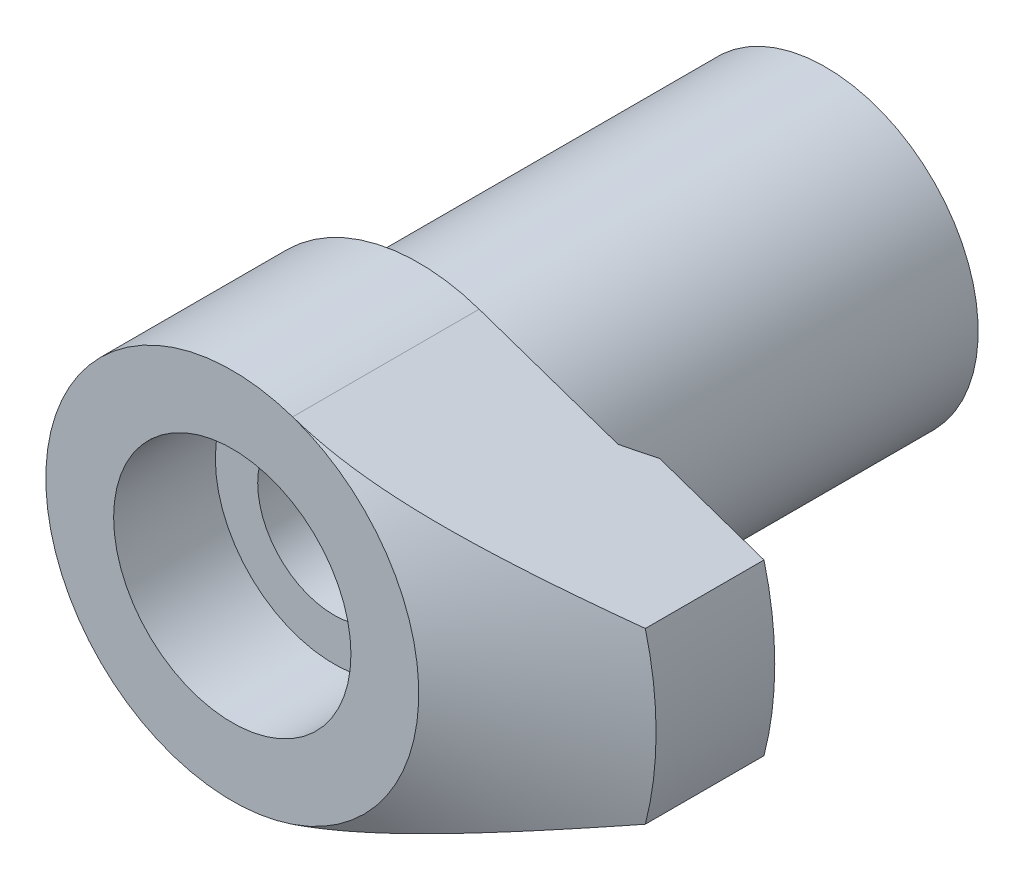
ISO-10303-21;
HEADER;
FILE_DESCRIPTION(('STEP AP214'),'2;1');
FILE_NAME('part.step','',(''),(''),'','','');
FILE_SCHEMA(('AUTOMOTIVE_DESIGN { 1 0 10303 214 1 1 1 1 }'));
ENDSEC;
DATA;
#1=APPLICATION_CONTEXT('core data for automotive mechanical design processes');
#2=APPLICATION_PROTOCOL_DEFINITION('international standard','automotive_design',2000,#1);
#3=PRODUCT_CONTEXT('',#1,'mechanical');
#4=PRODUCT('Part','Part','',(#3));
#5=PRODUCT_RELATED_PRODUCT_CATEGORY('part','',(#4));
#6=PRODUCT_DEFINITION_FORMATION('','',#4);
#7=PRODUCT_DEFINITION_CONTEXT('part definition',#1,'design');
#8=PRODUCT_DEFINITION('design','',#6,#7);
#9=PRODUCT_DEFINITION_SHAPE('','',#8);
#10=(LENGTH_UNIT() NAMED_UNIT(*) SI_UNIT(.MILLI.,.METRE.));
#11=(NAMED_UNIT(*) PLANE_ANGLE_UNIT() SI_UNIT($,.RADIAN.));
#12=(NAMED_UNIT(*) SI_UNIT($,.STERADIAN.) SOLID_ANGLE_UNIT());
#13=UNCERTAINTY_MEASURE_WITH_UNIT(LENGTH_MEASURE(1.E-05),#10,'distance_accuracy_value','');
#14=(GEOMETRIC_REPRESENTATION_CONTEXT(3) GLOBAL_UNCERTAINTY_ASSIGNED_CONTEXT((#13)) GLOBAL_UNIT_ASSIGNED_CONTEXT((#10,
#11,#12)) REPRESENTATION_CONTEXT('',''));
#15=CARTESIAN_POINT('',(0.,0.,0.));
#16=DIRECTION('',(0.,0.,1.));
#17=DIRECTION('',(1.,0.,0.));
#18=AXIS2_PLACEMENT_3D('',#15,#16,#17);
#19=CARTESIAN_POINT('',(3.561184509,-10.407591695,23.));
#20=DIRECTION('',(0.323744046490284,-0.946144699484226,0.));
#21=DIRECTION('',(0.946144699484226,0.323744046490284,0.));
#22=AXIS2_PLACEMENT_3D('',#19,#20,#21);
#23=PLANE('',#22);
#24=DIRECTION('',(0.,0.,1.));
#25=VECTOR('',#24,1.);
#26=CARTESIAN_POINT('',(3.5611845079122,-10.4075916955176,29.));
#27=LINE('',#26,#25);
#28=CARTESIAN_POINT('',(3.56118450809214,-10.4075916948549,34.9999999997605));
#29=VERTEX_POINT('',#28);
#30=CARTESIAN_POINT('',(3.56118450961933,-10.4075916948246,24.));
#31=VERTEX_POINT('',#30);
#32=EDGE_CURVE('E179',#29,#31,#27,.F.);
#33=ORIENTED_EDGE('',*,*,#32,.T.);
#34=DIRECTION('',(-0.946144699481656,-0.323744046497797,0.));
#35=VECTOR('',#34,1.);
#36=CARTESIAN_POINT('',(11.7550379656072,-7.60388600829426,24.));
#37=LINE('',#36,#35);
#38=CARTESIAN_POINT('',(11.7550379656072,-7.60388600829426,24.));
#39=VERTEX_POINT('',#38);
#40=EDGE_CURVE('E183',#39,#31,#37,.T.);
#41=ORIENTED_EDGE('',*,*,#40,.F.);
#42=CARTESIAN_POINT('',(-5.51352459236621,-13.5127013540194,23.405752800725));
#43=CARTESIAN_POINT('',(-5.29385984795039,-13.4375382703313,23.5583055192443));
#44=CARTESIAN_POINT('',(-5.07283624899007,-13.361910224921,23.7087069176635));
#45=CARTESIAN_POINT('',(-4.62770367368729,-13.2095984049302,24.0044490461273));
#46=CARTESIAN_POINT('',(-4.40359392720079,-13.132914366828,24.1497884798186));
#47=CARTESIAN_POINT('',(-3.95088257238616,-12.9780093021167,24.4352956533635));
#48=CARTESIAN_POINT('',(-3.72226389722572,-12.8997824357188,24.5754332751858));
#49=CARTESIAN_POINT('',(-3.26133619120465,-12.742065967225,24.8487307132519));
#50=CARTESIAN_POINT('',(-3.02902740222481,-12.662576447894,24.9818909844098));
#51=CARTESIAN_POINT('',(-2.55370158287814,-12.4999333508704,25.243727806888));
#52=CARTESIAN_POINT('',(-2.31056782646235,-12.416739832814,25.3721695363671));
#53=CARTESIAN_POINT('',(-1.81972825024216,-12.2487883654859,25.618879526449));
#54=CARTESIAN_POINT('',(-1.57202197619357,-12.1640302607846,25.7371467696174));
#55=CARTESIAN_POINT('',(-0.822554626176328,-11.9075836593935,26.0736034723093));
#56=CARTESIAN_POINT('',(-0.313320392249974,-11.733338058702,26.2740849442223));
#57=CARTESIAN_POINT('',(0.513557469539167,-11.4504037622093,26.5422767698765));
#58=CARTESIAN_POINT('',(0.825171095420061,-11.3437783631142,26.6308624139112));
#59=CARTESIAN_POINT('',(1.45420512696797,-11.1285406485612,26.7815153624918));
#60=CARTESIAN_POINT('',(1.77162568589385,-11.0199282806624,26.8435819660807));
#61=CARTESIAN_POINT('',(2.40702756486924,-10.8025116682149,26.9375068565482));
#62=CARTESIAN_POINT('',(2.72496644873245,-10.693721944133,26.9696816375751));
#63=CARTESIAN_POINT('',(3.36230317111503,-10.4756432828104,27.0031334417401));
#64=CARTESIAN_POINT('',(3.68170091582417,-10.3663543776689,27.0044124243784));
#65=CARTESIAN_POINT('',(4.32018584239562,-10.1478828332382,26.9759572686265));
#66=CARTESIAN_POINT('',(4.63926929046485,-10.0387014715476,26.9461310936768));
#67=CARTESIAN_POINT('',(5.2737080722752,-9.82161440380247,26.8570387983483));
#68=CARTESIAN_POINT('',(5.58906301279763,-9.71370883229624,26.7977696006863));
#69=CARTESIAN_POINT('',(6.21598251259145,-9.49919465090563,26.6524021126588));
#70=CARTESIAN_POINT('',(6.52751551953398,-9.39259683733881,26.5661538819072));
#71=CARTESIAN_POINT('',(7.14395167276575,-9.18166976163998,26.3706200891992));
#72=CARTESIAN_POINT('',(7.44885485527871,-9.07734048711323,26.2613346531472));
#73=CARTESIAN_POINT('',(8.11914838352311,-8.84798493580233,25.9968116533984));
#74=CARTESIAN_POINT('',(8.482828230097,-8.72354394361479,25.8367627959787));
#75=CARTESIAN_POINT('',(9.20040315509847,-8.47801003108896,25.4936176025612));
#76=CARTESIAN_POINT('',(9.55429325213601,-8.35691881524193,25.310509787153));
#77=CARTESIAN_POINT('',(10.2537453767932,-8.11758601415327,24.9258005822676));
#78=CARTESIAN_POINT('',(10.5992902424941,-7.9993503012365,24.7241646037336));
#79=CARTESIAN_POINT('',(11.2824049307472,-7.76560771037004,24.3065475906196));
#80=CARTESIAN_POINT('',(11.61997600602,-7.65010040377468,24.090568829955));
#81=CARTESIAN_POINT('',(12.2912184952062,-7.42042014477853,23.6452169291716));
#82=CARTESIAN_POINT('',(12.6248296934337,-7.30626779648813,23.4157428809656));
#83=CARTESIAN_POINT('',(13.2861084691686,-7.07999683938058,22.9474332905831));
#84=CARTESIAN_POINT('',(13.6137758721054,-6.96787829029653,22.7085974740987));
#85=CARTESIAN_POINT('',(14.2636754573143,-6.74550097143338,22.2235885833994));
#86=CARTESIAN_POINT('',(14.5859130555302,-6.63524034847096,21.9774235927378));
#87=CARTESIAN_POINT('',(15.2260352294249,-6.41620858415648,21.4788737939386));
#88=CARTESIAN_POINT('',(15.5439198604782,-6.30743742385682,21.2264890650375));
#89=CARTESIAN_POINT('',(16.2083716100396,-6.08008076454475,20.690404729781));
#90=CARTESIAN_POINT('',(16.5545361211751,-5.96163302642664,20.4061485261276));
#91=CARTESIAN_POINT('',(17.2430098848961,-5.72605671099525,19.8324727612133));
#92=CARTESIAN_POINT('',(17.585319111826,-5.6089281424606,19.5430531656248));
#93=CARTESIAN_POINT('',(18.2667554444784,-5.37575983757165,18.9598186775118));
#94=CARTESIAN_POINT('',(18.6058814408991,-5.25972048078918,18.6660023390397));
#95=CARTESIAN_POINT('',(19.2813000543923,-5.02861126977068,18.0747529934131));
#96=CARTESIAN_POINT('',(19.6175926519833,-4.91354142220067,17.7773199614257));
#97=CARTESIAN_POINT('',(20.2791843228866,-4.68716340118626,17.1870087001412));
#98=CARTESIAN_POINT('',(20.6045451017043,-4.57583411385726,16.8942076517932));
#99=CARTESIAN_POINT('',(21.2532359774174,-4.35387038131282,16.3061024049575));
#100=CARTESIAN_POINT('',(21.5765660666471,-4.24323593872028,16.0107981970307));
#101=CARTESIAN_POINT('',(22.2212557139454,-4.02264131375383,15.4182031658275));
#102=CARTESIAN_POINT('',(22.542616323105,-3.91268077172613,15.120913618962));
#103=CARTESIAN_POINT('',(23.1837590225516,-3.6932998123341,14.5244496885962));
#104=CARTESIAN_POINT('',(23.5035411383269,-3.58387938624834,14.2252753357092));
#105=CARTESIAN_POINT('',(23.8226389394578,-3.47469311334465,13.9252908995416));
#106=B_SPLINE_CURVE_WITH_KNOTS('',3,(#42,#43,#44,#45,#46,#47,#48,#49,#50,#51,#52,#53,#54,#55,
#56,#57,#58,#59,#60,#61,#62,#63,#64,#65,#66,#67,#68,#69,#70,#71,#72,#73,#74,#75,#76,#77,#78,#79,
#80,#81,#82,#83,#84,#85,#86,#87,#88,#89,#90,#91,#92,#93,#94,#95,#96,#97,#98,#99,#100,#101,#102,
#103,#104,#105),.UNSPECIFIED.,.F.,.F.,(4,2,2,2,2,2,2,2,2,2,2,2,2,2,2,2,2,2,2,2,2,2,2,2,2,2,2,2,
2,2,2,4),(0.,0.83342434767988,1.66706058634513,2.50494362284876,3.3427719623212,
4.20440036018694,5.06611481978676,6.78550910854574,7.80779402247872,8.8301059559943,
9.84146601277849,10.8527619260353,11.867058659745,12.88146142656,13.9016051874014,
14.9217433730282,16.1698660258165,17.4186125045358,18.6697394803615,19.9206685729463,
21.1825749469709,22.4445183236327,23.7051179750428,24.9657015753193,26.3555912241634,
27.745490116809,29.1358566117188,30.5262326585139,31.8811642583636,33.2361009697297,
34.5902373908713,35.9443518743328),.UNSPECIFIED.);
#107=CARTESIAN_POINT('',(13.2100050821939,-7.10603727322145,23.));
#108=VERTEX_POINT('',#107);
#109=EDGE_CURVE('E128',#39,#108,#106,.T.);
#110=ORIENTED_EDGE('',*,*,#109,.T.);
#111=DIRECTION('',(0.946144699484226,0.323744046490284,0.));
#112=VECTOR('',#111,1.);
#113=CARTESIAN_POINT('',(3.561184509,-10.407591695,23.));
#114=LINE('',#113,#112);
#115=CARTESIAN_POINT('',(19.3649167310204,-4.99999999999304,23.));
#116=VERTEX_POINT('',#115);
#117=EDGE_CURVE('E62',#108,#116,#114,.T.);
#118=ORIENTED_EDGE('',*,*,#117,.T.);
#119=DIRECTION('',(0.,0.,1.));
#120=VECTOR('',#119,1.);
#121=CARTESIAN_POINT('',(19.364916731,-5.,29.036));
#122=LINE('',#121,#120);
#123=CARTESIAN_POINT('',(19.3649167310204,-4.99999999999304,30.00000000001));
#124=VERTEX_POINT('',#123);
#125=EDGE_CURVE('E80',#116,#124,#122,.T.);
#126=ORIENTED_EDGE('',*,*,#125,.T.);
#127=CARTESIAN_POINT('',(19.3649167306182,-5.00000000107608,30.0000000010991));
#128=CARTESIAN_POINT('',(19.1187005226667,-5.0842482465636,30.1207388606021));
#129=CARTESIAN_POINT('',(18.8721786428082,-5.16860108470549,30.240781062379));
#130=CARTESIAN_POINT('',(18.3784534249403,-5.3375399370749,30.4792980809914));
#131=CARTESIAN_POINT('',(18.1312500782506,-5.42212595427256,30.5977728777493));
#132=CARTESIAN_POINT('',(17.388409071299,-5.67630520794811,30.9506341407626));
#133=CARTESIAN_POINT('',(16.8916528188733,-5.84628119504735,31.1824021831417));
#134=CARTESIAN_POINT('',(15.8906602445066,-6.18879263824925,31.6388921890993));
#135=CARTESIAN_POINT('',(15.3863957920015,-6.36133771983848,31.8635454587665));
#136=CARTESIAN_POINT('',(14.3734483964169,-6.70793976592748,32.3013747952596));
#137=CARTESIAN_POINT('',(13.8647657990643,-6.88199661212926,32.5145517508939));
#138=CARTESIAN_POINT('',(12.8556614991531,-7.22728365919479,32.9205785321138));
#139=CARTESIAN_POINT('',(12.3553813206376,-7.39846543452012,33.1138188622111));
#140=CARTESIAN_POINT('',(11.3487230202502,-7.74291552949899,33.482115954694));
#141=CARTESIAN_POINT('',(10.8423440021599,-7.91618415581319,33.6571700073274));
#142=CARTESIAN_POINT('',(9.82435730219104,-8.26451050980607,33.9831483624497));
#143=CARTESIAN_POINT('',(9.31277122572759,-8.43956084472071,34.1341472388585));
#144=CARTESIAN_POINT('',(8.28250844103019,-8.79208772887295,34.4060197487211));
#145=CARTESIAN_POINT('',(7.76383439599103,-8.96956336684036,34.5269043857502));
#146=CARTESIAN_POINT('',(6.93961919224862,-9.25158657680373,34.6882685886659));
#147=CARTESIAN_POINT('',(6.63624451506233,-9.35539283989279,34.741176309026));
#148=CARTESIAN_POINT('',(6.02753836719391,-9.56367492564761,34.8331245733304));
#149=CARTESIAN_POINT('',(5.72220652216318,-9.6681508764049,34.8721623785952));
#150=CARTESIAN_POINT('',(5.1080019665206,-9.87831436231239,34.935441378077));
#151=CARTESIAN_POINT('',(4.79911940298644,-9.98400526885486,34.9595776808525));
#152=CARTESIAN_POINT('',(4.33522567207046,-10.1427366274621,34.9837908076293));
#153=CARTESIAN_POINT('',(4.18047831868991,-10.195686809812,34.9898633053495));
#154=CARTESIAN_POINT('',(3.87088432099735,-10.3016211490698,34.9979700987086));
#155=CARTESIAN_POINT('',(3.71603767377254,-10.3546053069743,35.0000042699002));
#156=CARTESIAN_POINT('',(3.56118450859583,-10.4075916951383,34.9999999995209));
#157=B_SPLINE_CURVE_WITH_KNOTS('',3,(#127,#128,#129,#130,#131,#132,#133,#134,#135,#136,#137,
#138,#139,#140,#141,#142,#143,#144,#145,#146,#147,#148,#149,#150,#151,#152,#153,#154,#155,#156),
.UNSPECIFIED.,.F.,.F.,(4,2,2,2,2,2,2,2,2,2,2,2,2,2,4),(0.,0.860627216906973,1.72126544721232,
3.44293491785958,5.17797421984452,6.91287895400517,8.60151177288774,10.2903958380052,
11.9739377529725,13.6568636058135,14.6315403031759,15.6064093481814,16.5880644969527,
17.0790259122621,17.5700024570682),.UNSPECIFIED.);
#158=EDGE_CURVE('E87',#124,#29,#157,.T.);
#159=ORIENTED_EDGE('',*,*,#158,.T.);
#160=EDGE_LOOP('',(#33,#41,#110,#118,#126,#159));
#161=FACE_BOUND('',#160,.T.);
#162=ADVANCED_FACE('F14',(#161),#23,.T.);
#163=CARTESIAN_POINT('',(3.561184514,10.407591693,23.));
#164=DIRECTION('',(-0.323744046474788,-0.946144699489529,0.));
#165=DIRECTION('',(0.946144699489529,-0.323744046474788,0.));
#166=AXIS2_PLACEMENT_3D('',#163,#164,#165);
#167=PLANE('',#166);
#168=DIRECTION('',(0.946144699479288,-0.323744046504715,0.));
#169=VECTOR('',#168,1.);
#170=CARTESIAN_POINT('',(3.5611845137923,10.4075916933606,24.));
#171=LINE('',#170,#169);
#172=CARTESIAN_POINT('',(3.5611845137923,10.4075916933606,24.));
#173=VERTEX_POINT('',#172);
#174=CARTESIAN_POINT('',(11.7550379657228,7.60388600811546,24.));
#175=VERTEX_POINT('',#174);
#176=EDGE_CURVE('E35',#173,#175,#171,.T.);
#177=ORIENTED_EDGE('',*,*,#176,.F.);
#178=DIRECTION('',(0.,0.,-1.));
#179=VECTOR('',#178,1.);
#180=CARTESIAN_POINT('',(3.56118451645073,10.4075916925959,29.));
#181=LINE('',#180,#179);
#182=CARTESIAN_POINT('',(3.56118451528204,10.4075916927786,34.9999999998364));
#183=VERTEX_POINT('',#182);
#184=EDGE_CURVE('E43',#173,#183,#181,.F.);
#185=ORIENTED_EDGE('',*,*,#184,.T.);
#186=CARTESIAN_POINT('',(3.56118451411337,10.4075916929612,34.9999999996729));
#187=CARTESIAN_POINT('',(3.7166509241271,10.3543954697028,35.0000043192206));
#188=CARTESIAN_POINT('',(3.87211067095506,10.3012015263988,34.9979539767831));
#189=CARTESIAN_POINT('',(4.18292986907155,10.1948479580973,34.9897829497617));
#190=CARTESIAN_POINT('',(4.33828932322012,10.1416883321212,34.9836623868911));
#191=CARTESIAN_POINT('',(4.80395445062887,9.98235085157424,34.9592613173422));
#192=CARTESIAN_POINT('',(5.1139935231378,9.87626422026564,34.9349413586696));
#193=CARTESIAN_POINT('',(5.73154985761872,9.66495385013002,34.8710801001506));
#194=CARTESIAN_POINT('',(6.03907213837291,9.5597283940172,34.8315919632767));
#195=CARTESIAN_POINT('',(6.6522214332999,9.3499259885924,34.7385436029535));
#196=CARTESIAN_POINT('',(6.95784826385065,9.24534910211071,34.6849820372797));
#197=CARTESIAN_POINT('',(7.56383144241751,9.03799873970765,34.5657617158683));
#198=CARTESIAN_POINT('',(7.86421000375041,8.93521766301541,34.5002281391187));
#199=CARTESIAN_POINT('',(8.46259484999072,8.7304672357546,34.3581288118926));
#200=CARTESIAN_POINT('',(8.76060117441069,8.62849787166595,34.2815632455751));
#201=CARTESIAN_POINT('',(9.65159010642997,8.32362657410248,34.0372718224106));
#202=CARTESIAN_POINT('',(10.2410350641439,8.12193512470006,33.8550557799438));
#203=CARTESIAN_POINT('',(11.1898285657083,7.797284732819,33.5361600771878));
#204=CARTESIAN_POINT('',(11.5519154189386,7.67338881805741,33.4083102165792));
#205=CARTESIAN_POINT('',(12.2730488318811,7.42663729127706,33.1433085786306));
#206=CARTESIAN_POINT('',(12.6320953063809,7.30378170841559,33.0061565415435));
#207=CARTESIAN_POINT('',(13.3474193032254,7.05901800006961,32.7241560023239));
#208=CARTESIAN_POINT('',(13.7036970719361,6.93710979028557,32.5793081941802));
#209=CARTESIAN_POINT('',(14.4138554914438,6.69411359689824,32.2831850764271));
#210=CARTESIAN_POINT('',(14.7677360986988,6.57302562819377,32.1319096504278));
#211=CARTESIAN_POINT('',(15.4780262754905,6.32998435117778,31.8219614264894));
#212=CARTESIAN_POINT('',(15.8344080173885,6.20804056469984,31.6632175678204));
#213=CARTESIAN_POINT('',(16.5452937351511,5.96479551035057,31.3410939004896));
#214=CARTESIAN_POINT('',(16.8997976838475,5.84349425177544,31.1777140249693));
#215=CARTESIAN_POINT('',(17.6068983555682,5.6015443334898,30.8471717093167));
#216=CARTESIAN_POINT('',(17.9594963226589,5.48089524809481,30.6800122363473));
#217=CARTESIAN_POINT('',(18.6632399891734,5.2400940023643,30.3423641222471));
#218=CARTESIAN_POINT('',(19.0143857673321,5.1199418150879,30.1718756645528));
#219=CARTESIAN_POINT('',(19.3649167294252,5.00000000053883,30.0000000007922));
#220=B_SPLINE_CURVE_WITH_KNOTS('',3,(#186,#187,#188,#189,#190,#191,#192,#193,#194,#195,#196,
#197,#198,#199,#200,#201,#202,#203,#204,#205,#206,#207,#208,#209,#210,#211,#212,#213,#214,#215,
#216,#217,#218,#219),.UNSPECIFIED.,.F.,.F.,(4,2,2,2,2,2,2,2,2,2,2,2,2,2,2,2,4),(0.,
0.492920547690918,0.985826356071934,1.97117354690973,2.95309824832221,3.93511663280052,
4.90740055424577,5.87966824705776,7.82584034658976,9.0362160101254,10.2466254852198,
11.4569259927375,12.6672484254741,13.8934668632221,15.1197029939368,16.345007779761,
17.5702452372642),.UNSPECIFIED.);
#221=CARTESIAN_POINT('',(19.3649167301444,5.00000000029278,30.0000000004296));
#222=VERTEX_POINT('',#221);
#223=EDGE_CURVE('E88',#183,#222,#220,.T.);
#224=ORIENTED_EDGE('',*,*,#223,.T.);
#225=DIRECTION('',(0.,0.,1.));
#226=VECTOR('',#225,1.);
#227=CARTESIAN_POINT('',(19.364916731,5.,29.036));
#228=LINE('',#227,#226);
#229=CARTESIAN_POINT('',(19.3649167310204,4.99999999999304,23.));
#230=VERTEX_POINT('',#229);
#231=EDGE_CURVE('E83',#230,#222,#228,.T.);
#232=ORIENTED_EDGE('',*,*,#231,.F.);
#233=DIRECTION('',(0.946144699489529,-0.323744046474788,0.));
#234=VECTOR('',#233,1.);
#235=CARTESIAN_POINT('',(11.4630506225,7.7037958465,23.));
#236=LINE('',#235,#234);
#237=CARTESIAN_POINT('',(13.2100050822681,7.10603727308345,23.));
#238=VERTEX_POINT('',#237);
#239=EDGE_CURVE('E192',#238,#230,#236,.T.);
#240=ORIENTED_EDGE('',*,*,#239,.F.);
#241=CARTESIAN_POINT('',(-4.86695694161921,13.2914641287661,23.8454852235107));
#242=CARTESIAN_POINT('',(-4.66403877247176,13.2220312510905,23.9804361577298));
#243=CARTESIAN_POINT('',(-4.45986871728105,13.1521700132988,24.1133163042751));
#244=CARTESIAN_POINT('',(-4.04872912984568,13.0114896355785,24.3742624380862));
#245=CARTESIAN_POINT('',(-3.84175893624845,12.9406702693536,24.5023272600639));
#246=CARTESIAN_POINT('',(-3.42392394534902,12.7976989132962,24.7534435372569));
#247=CARTESIAN_POINT('',(-3.21304622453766,12.7255425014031,24.8764710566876));
#248=CARTESIAN_POINT('',(-2.78803155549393,12.5801144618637,25.1160452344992));
#249=CARTESIAN_POINT('',(-2.57389480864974,12.5068429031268,25.2325922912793));
#250=CARTESIAN_POINT('',(-2.13700147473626,12.3573503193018,25.4608744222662));
#251=CARTESIAN_POINT('',(-1.91416074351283,12.281100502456,25.5724308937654));
#252=CARTESIAN_POINT('',(-1.46460604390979,12.1272755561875,25.7864472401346));
#253=CARTESIAN_POINT('',(-1.23789174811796,12.0497003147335,25.8889063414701));
#254=CARTESIAN_POINT('',(-0.552399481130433,11.8151441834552,26.1802059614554));
#255=CARTESIAN_POINT('',(-0.0874116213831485,11.6560384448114,26.3534298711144));
#256=CARTESIAN_POINT('',(0.690008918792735,11.3900270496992,26.5932521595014));
#257=CARTESIAN_POINT('',(0.99803568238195,11.2846289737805,26.6758754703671));
#258=CARTESIAN_POINT('',(1.61946459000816,11.0719935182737,26.814795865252));
#259=CARTESIAN_POINT('',(1.93286679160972,10.9647561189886,26.8710926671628));
#260=CARTESIAN_POINT('',(2.56012310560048,10.7501266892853,26.9540774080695));
#261=CARTESIAN_POINT('',(2.87394345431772,10.6427462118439,26.9810467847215));
#262=CARTESIAN_POINT('',(3.50260985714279,10.4276342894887,27.0048357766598));
#263=CARTESIAN_POINT('',(3.81745586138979,10.319902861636,27.0016568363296));
#264=CARTESIAN_POINT('',(4.44610798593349,10.1047958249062,26.9653042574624));
#265=CARTESIAN_POINT('',(4.75991140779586,9.99742113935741,26.9320793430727));
#266=CARTESIAN_POINT('',(5.38365298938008,9.78399435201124,26.837394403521));
#267=CARTESIAN_POINT('',(5.69359075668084,9.67794238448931,26.7759315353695));
#268=CARTESIAN_POINT('',(6.30957225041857,9.46717088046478,26.6273589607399));
#269=CARTESIAN_POINT('',(6.61558658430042,9.36246140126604,26.5401148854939));
#270=CARTESIAN_POINT('',(7.22113915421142,9.15525838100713,26.3436370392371));
#271=CARTESIAN_POINT('',(7.52067754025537,9.05276478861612,26.2344037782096));
#272=CARTESIAN_POINT('',(8.1925984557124,8.82285239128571,25.9656248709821));
#273=CARTESIAN_POINT('',(8.56295236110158,8.69612772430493,25.8004445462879));
#274=CARTESIAN_POINT('',(9.29353622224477,8.44614252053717,25.4465432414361));
#275=CARTESIAN_POINT('',(9.65376082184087,8.32288381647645,25.25781008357));
#276=CARTESIAN_POINT('',(10.3656588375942,8.07929238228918,24.8615302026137));
#277=CARTESIAN_POINT('',(10.717314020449,7.95896589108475,24.6539471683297));
#278=CARTESIAN_POINT('',(11.4124588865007,7.72110691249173,24.2242621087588));
#279=CARTESIAN_POINT('',(11.7559499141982,7.60357396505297,24.0021624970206));
#280=CARTESIAN_POINT('',(12.4388146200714,7.36991691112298,23.54450632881));
#281=CARTESIAN_POINT('',(12.7781297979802,7.2538128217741,23.3088527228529));
#282=CARTESIAN_POINT('',(13.4507306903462,7.02366775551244,22.8281337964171));
#283=CARTESIAN_POINT('',(13.7840162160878,6.90962684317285,22.5830681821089));
#284=CARTESIAN_POINT('',(14.445080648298,6.68342922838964,22.0855883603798));
#285=CARTESIAN_POINT('',(14.7728651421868,6.57127061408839,21.8331824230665));
#286=CARTESIAN_POINT('',(15.4240425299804,6.34845606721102,21.3221441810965));
#287=CARTESIAN_POINT('',(15.7474354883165,6.23780011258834,21.0635119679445));
#288=CARTESIAN_POINT('',(16.3762676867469,6.02263145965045,20.5526197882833));
#289=CARTESIAN_POINT('',(16.6818692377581,5.91806322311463,20.30058258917));
#290=CARTESIAN_POINT('',(17.2900958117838,5.70994523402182,19.7925240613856));
#291=CARTESIAN_POINT('',(17.5927207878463,5.60639549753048,19.5365026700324));
#292=CARTESIAN_POINT('',(18.4968946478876,5.29701268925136,18.7632444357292));
#293=CARTESIAN_POINT('',(19.0945753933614,5.09250318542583,18.2409503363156));
#294=CARTESIAN_POINT('',(19.9786257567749,4.79000607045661,17.4558462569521));
#295=CARTESIAN_POINT('',(20.2680186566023,4.69098397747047,17.1968124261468));
#296=CARTESIAN_POINT('',(20.8451185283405,4.49351666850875,16.676650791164));
#297=CARTESIAN_POINT('',(21.1328254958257,4.39507145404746,16.4155229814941));
#298=CARTESIAN_POINT('',(21.7066092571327,4.1987388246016,15.8915628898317));
#299=CARTESIAN_POINT('',(21.9926867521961,4.10085116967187,15.6287314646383));
#300=CARTESIAN_POINT('',(22.5635008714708,3.90553466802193,15.1014544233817));
#301=CARTESIAN_POINT('',(22.8482375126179,3.80810581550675,14.837008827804));
#302=CARTESIAN_POINT('',(23.1323840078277,3.71087889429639,14.5718585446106));
#303=B_SPLINE_CURVE_WITH_KNOTS('',3,(#241,#242,#243,#244,#245,#246,#247,#248,#249,#250,#251,
#252,#253,#254,#255,#256,#257,#258,#259,#260,#261,#262,#263,#264,#265,#266,#267,#268,#269,#270,
#271,#272,#273,#274,#275,#276,#277,#278,#279,#280,#281,#282,#283,#284,#285,#286,#287,#288,#289,
#290,#291,#292,#293,#294,#295,#296,#297,#298,#299,#300,#301,#302),.UNSPECIFIED.,.F.,.F.,(4,2,2,
2,2,2,2,2,2,2,2,2,2,2,2,2,2,2,2,2,2,2,2,2,2,2,2,2,2,2,4),(0.,0.760194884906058,1.52057256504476,
2.28422116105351,3.0478227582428,3.8294548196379,4.61115327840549,6.17149931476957,
7.17824857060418,8.18500861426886,9.18201972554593,10.1789830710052,11.1776510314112,
12.1764195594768,13.1804882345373,14.1845336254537,15.4580839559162,16.7322955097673,
18.0090159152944,19.2855245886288,20.5727142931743,21.8599442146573,23.1457761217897,
24.4315891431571,25.6606358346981,26.8897018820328,29.348503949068,30.5509426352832,
31.7533844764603,32.955262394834,34.157125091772),.UNSPECIFIED.);
#304=EDGE_CURVE('E9',#175,#238,#303,.T.);
#305=ORIENTED_EDGE('',*,*,#304,.F.);
#306=EDGE_LOOP('',(#177,#185,#224,#232,#240,#305));
#307=FACE_BOUND('',#306,.T.);
#308=ADVANCED_FACE('F123',(#307),#167,.F.);
#309=CARTESIAN_POINT('',(0.,0.,35.));
#310=DIRECTION('',(0.,0.,-1.));
#311=DIRECTION('',(-1.,0.,0.));
#312=AXIS2_PLACEMENT_3D('',#309,#310,#311);
#313=CYLINDRICAL_SURFACE('',#312,11.);
#314=CARTESIAN_POINT('',(0.,0.,24.));
#315=DIRECTION('',(0.,0.,-1.));
#316=DIRECTION('',(-1.,0.,0.));
#317=AXIS2_PLACEMENT_3D('',#314,#315,#316);
#318=CIRCLE('',#317,10.999999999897);
#319=EDGE_CURVE('E178',#31,#173,#318,.T.);
#320=ORIENTED_EDGE('',*,*,#319,.F.);
#321=ORIENTED_EDGE('',*,*,#32,.F.);
#322=CARTESIAN_POINT('',(0.,0.,35.));
#323=DIRECTION('',(0.,0.,-1.));
#324=DIRECTION('',(-1.,0.,0.));
#325=AXIS2_PLACEMENT_3D('',#322,#323,#324);
#326=CIRCLE('',#325,11.);
#327=EDGE_CURVE('E100',#183,#29,#326,.F.);
#328=ORIENTED_EDGE('',*,*,#327,.F.);
#329=ORIENTED_EDGE('',*,*,#184,.F.);
#330=EDGE_LOOP('',(#320,#321,#328,#329));
#331=FACE_BOUND('',#330,.T.);
#332=ADVANCED_FACE('F166',(#331),#313,.T.);
#333=CARTESIAN_POINT('',(-11.186,-11.132,23.));
#334=DIRECTION('',(0.,0.,1.));
#335=DIRECTION('',(1.,0.,0.));
#336=AXIS2_PLACEMENT_3D('',#333,#334,#335);
#337=PLANE('',#336);
#338=CARTESIAN_POINT('',(0.,0.,23.));
#339=DIRECTION('',(0.,0.,-1.));
#340=DIRECTION('',(-1.,0.,0.));
#341=AXIS2_PLACEMENT_3D('',#338,#339,#340);
#342=CIRCLE('',#341,15.);
#343=EDGE_CURVE('E70',#238,#108,#342,.T.);
#344=ORIENTED_EDGE('',*,*,#343,.F.);
#345=ORIENTED_EDGE('',*,*,#239,.T.);
#346=CARTESIAN_POINT('',(0.,0.,23.));
#347=DIRECTION('',(0.,0.,-1.));
#348=DIRECTION('',(-1.,0.,0.));
#349=AXIS2_PLACEMENT_3D('',#346,#347,#348);
#350=CIRCLE('',#349,20.);
#351=EDGE_CURVE('E193',#116,#230,#350,.F.);
#352=ORIENTED_EDGE('',*,*,#351,.F.);
#353=ORIENTED_EDGE('',*,*,#117,.F.);
#354=EDGE_LOOP('',(#344,#345,#352,#353));
#355=FACE_BOUND('',#354,.T.);
#356=ADVANCED_FACE('F125',(#355),#337,.F.);
#357=CARTESIAN_POINT('',(0.,0.,35.));
#358=DIRECTION('',(0.,0.,-1.));
#359=DIRECTION('',(-1.,0.,0.));
#360=AXIS2_PLACEMENT_3D('',#357,#358,#359);
#361=CYLINDRICAL_SURFACE('',#360,4.5);
#362=CARTESIAN_POINT('',(0.,0.,29.));
#363=DIRECTION('',(0.,0.,1.));
#364=DIRECTION('',(1.,0.,0.));
#365=AXIS2_PLACEMENT_3D('',#362,#363,#364);
#366=CIRCLE('',#365,4.5);
#367=CARTESIAN_POINT('',(4.5,0.,29.));
#368=VERTEX_POINT('',#367);
#369=EDGE_CURVE('E194',#368,#368,#366,.T.);
#370=ORIENTED_EDGE('',*,*,#369,.T.);
#371=EDGE_LOOP('',(#370));
#372=FACE_BOUND('',#371,.T.);
#373=CARTESIAN_POINT('',(0.,0.,10.));
#374=DIRECTION('',(0.,0.,-1.));
#375=DIRECTION('',(-1.,0.,0.));
#376=AXIS2_PLACEMENT_3D('',#373,#374,#375);
#377=CIRCLE('',#376,4.5);
#378=CARTESIAN_POINT('',(-4.5,0.,10.));
#379=VERTEX_POINT('',#378);
#380=EDGE_CURVE('E28',#379,#379,#377,.T.);
#381=ORIENTED_EDGE('',*,*,#380,.T.);
#382=EDGE_LOOP('',(#381));
#383=FACE_BOUND('',#382,.T.);
#384=ADVANCED_FACE('F163',(#372,#383),#361,.F.);
#385=CARTESIAN_POINT('',(0.,0.,23.));
#386=DIRECTION('',(0.,0.,-1.));
#387=DIRECTION('',(-1.,0.,0.));
#388=AXIS2_PLACEMENT_3D('',#385,#386,#387);
#389=CYLINDRICAL_SURFACE('',#388,9.);
#390=CARTESIAN_POINT('',(0.,0.,0.));
#391=DIRECTION('',(0.,0.,-1.));
#392=DIRECTION('',(-1.,0.,0.));
#393=AXIS2_PLACEMENT_3D('',#390,#391,#392);
#394=CIRCLE('',#393,9.);
#395=CARTESIAN_POINT('',(-9.,0.,0.));
#396=VERTEX_POINT('',#395);
#397=EDGE_CURVE('E186',#396,#396,#394,.F.);
#398=ORIENTED_EDGE('',*,*,#397,.T.);
#399=EDGE_LOOP('',(#398));
#400=FACE_BOUND('',#399,.T.);
#401=CARTESIAN_POINT('',(0.,0.,24.));
#402=DIRECTION('',(0.,0.,-1.));
#403=DIRECTION('',(-1.,0.,0.));
#404=AXIS2_PLACEMENT_3D('',#401,#402,#403);
#405=CIRCLE('',#404,9.);
#406=CARTESIAN_POINT('',(-9.,0.,24.));
#407=VERTEX_POINT('',#406);
#408=EDGE_CURVE('E244',#407,#407,#405,.T.);
#409=ORIENTED_EDGE('',*,*,#408,.T.);
#410=EDGE_LOOP('',(#409));
#411=FACE_BOUND('',#410,.T.);
#412=ADVANCED_FACE('F124',(#400,#411),#389,.T.);
#413=CARTESIAN_POINT('',(0.,0.,30.));
#414=DIRECTION('',(0.,0.,-1.));
#415=DIRECTION('',(-1.,0.,0.));
#416=AXIS2_PLACEMENT_3D('',#413,#414,#415);
#417=CYLINDRICAL_SURFACE('',#416,20.);
#418=ORIENTED_EDGE('',*,*,#351,.T.);
#419=ORIENTED_EDGE('',*,*,#231,.T.);
#420=CARTESIAN_POINT('',(0.,0.,30.));
#421=DIRECTION('',(0.,0.,-1.));
#422=DIRECTION('',(-1.,0.,0.));
#423=AXIS2_PLACEMENT_3D('',#420,#421,#422);
#424=CIRCLE('',#423,20.);
#425=EDGE_CURVE('E77',#222,#124,#424,.T.);
#426=ORIENTED_EDGE('',*,*,#425,.T.);
#427=ORIENTED_EDGE('',*,*,#125,.F.);
#428=EDGE_LOOP('',(#418,#419,#426,#427));
#429=FACE_BOUND('',#428,.T.);
#430=ADVANCED_FACE('F79',(#429),#417,.T.);
#431=CARTESIAN_POINT('',(-9.108,-9.108,0.));
#432=DIRECTION('',(0.,0.,1.));
#433=DIRECTION('',(1.,0.,0.));
#434=AXIS2_PLACEMENT_3D('',#431,#432,#433);
#435=PLANE('',#434);
#436=CARTESIAN_POINT('',(0.,0.,0.));
#437=DIRECTION('',(0.,0.,-1.));
#438=DIRECTION('',(-1.,0.,0.));
#439=AXIS2_PLACEMENT_3D('',#436,#437,#438);
#440=CIRCLE('',#439,5.5);
#441=CARTESIAN_POINT('',(-5.5,0.,0.));
#442=VERTEX_POINT('',#441);
#443=EDGE_CURVE('E135',#442,#442,#440,.T.);
#444=ORIENTED_EDGE('',*,*,#443,.F.);
#445=EDGE_LOOP('',(#444));
#446=FACE_BOUND('',#445,.T.);
#447=ORIENTED_EDGE('',*,*,#397,.F.);
#448=EDGE_LOOP('',(#447));
#449=FACE_BOUND('',#448,.T.);
#450=ADVANCED_FACE('F225',(#446,#449),#435,.F.);
#451=CARTESIAN_POINT('',(0.,0.,35.));
#452=DIRECTION('',(0.,0.,-1.));
#453=DIRECTION('',(-1.,0.,0.));
#454=AXIS2_PLACEMENT_3D('',#451,#452,#453);
#455=CONICAL_SURFACE('',#454,10.999999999,1.06369782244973);
#456=ORIENTED_EDGE('',*,*,#158,.F.);
#457=ORIENTED_EDGE('',*,*,#425,.F.);
#458=ORIENTED_EDGE('',*,*,#223,.F.);
#459=CARTESIAN_POINT('',(0.,0.,35.));
#460=DIRECTION('',(0.,0.,-1.));
#461=DIRECTION('',(-1.,0.,0.));
#462=AXIS2_PLACEMENT_3D('',#459,#460,#461);
#463=CIRCLE('',#462,10.999999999);
#464=EDGE_CURVE('E97',#29,#183,#463,.F.);
#465=ORIENTED_EDGE('',*,*,#464,.F.);
#466=EDGE_LOOP('',(#456,#457,#458,#465));
#467=FACE_BOUND('',#466,.T.);
#468=ADVANCED_FACE('F95',(#467),#455,.T.);
#469=CARTESIAN_POINT('',(-11.132,-11.132,35.));
#470=DIRECTION('',(0.,0.,1.));
#471=DIRECTION('',(1.,0.,0.));
#472=AXIS2_PLACEMENT_3D('',#469,#470,#471);
#473=PLANE('',#472);
#474=CARTESIAN_POINT('',(0.,0.,35.));
#475=DIRECTION('',(0.,0.,1.));
#476=DIRECTION('',(1.,0.,0.));
#477=AXIS2_PLACEMENT_3D('',#474,#475,#476);
#478=CIRCLE('',#477,7.);
#479=CARTESIAN_POINT('',(7.,0.,35.));
#480=VERTEX_POINT('',#479);
#481=EDGE_CURVE('E208',#480,#480,#478,.T.);
#482=ORIENTED_EDGE('',*,*,#481,.F.);
#483=EDGE_LOOP('',(#482));
#484=FACE_BOUND('',#483,.T.);
#485=ORIENTED_EDGE('',*,*,#464,.T.);
#486=ORIENTED_EDGE('',*,*,#327,.T.);
#487=EDGE_LOOP('',(#485,#486));
#488=FACE_BOUND('',#487,.T.);
#489=ADVANCED_FACE('F16',(#484,#488),#473,.T.);
#490=CARTESIAN_POINT('',(0.,0.,29.));
#491=DIRECTION('',(0.,0.,1.));
#492=DIRECTION('',(1.,0.,0.));
#493=AXIS2_PLACEMENT_3D('',#490,#491,#492);
#494=CYLINDRICAL_SURFACE('',#493,7.);
#495=CARTESIAN_POINT('',(0.,0.,29.));
#496=DIRECTION('',(0.,0.,1.));
#497=DIRECTION('',(1.,0.,0.));
#498=AXIS2_PLACEMENT_3D('',#495,#496,#497);
#499=CIRCLE('',#498,7.);
#500=CARTESIAN_POINT('',(7.,0.,29.));
#501=VERTEX_POINT('',#500);
#502=EDGE_CURVE('E92',#501,#501,#499,.T.);
#503=ORIENTED_EDGE('',*,*,#502,.F.);
#504=EDGE_LOOP('',(#503));
#505=FACE_BOUND('',#504,.T.);
#506=ORIENTED_EDGE('',*,*,#481,.T.);
#507=EDGE_LOOP('',(#506));
#508=FACE_BOUND('',#507,.T.);
#509=ADVANCED_FACE('F158',(#505,#508),#494,.F.);
#510=CARTESIAN_POINT('',(0.,0.,29.));
#511=DIRECTION('',(0.,0.,1.));
#512=DIRECTION('',(1.,0.,0.));
#513=AXIS2_PLACEMENT_3D('',#510,#511,#512);
#514=PLANE('',#513);
#515=ORIENTED_EDGE('',*,*,#369,.F.);
#516=EDGE_LOOP('',(#515));
#517=FACE_BOUND('',#516,.T.);
#518=ORIENTED_EDGE('',*,*,#502,.T.);
#519=EDGE_LOOP('',(#518));
#520=FACE_BOUND('',#519,.T.);
#521=ADVANCED_FACE('F154',(#517,#520),#514,.T.);
#522=CARTESIAN_POINT('',(0.,0.,10.));
#523=DIRECTION('',(0.,0.,-1.));
#524=DIRECTION('',(-1.,0.,0.));
#525=AXIS2_PLACEMENT_3D('',#522,#523,#524);
#526=CYLINDRICAL_SURFACE('',#525,5.5);
#527=CARTESIAN_POINT('',(0.,0.,10.));
#528=DIRECTION('',(0.,0.,-1.));
#529=DIRECTION('',(-1.,0.,0.));
#530=AXIS2_PLACEMENT_3D('',#527,#528,#529);
#531=CIRCLE('',#530,5.5);
#532=CARTESIAN_POINT('',(-5.5,0.,10.));
#533=VERTEX_POINT('',#532);
#534=EDGE_CURVE('E138',#533,#533,#531,.T.);
#535=ORIENTED_EDGE('',*,*,#534,.F.);
#536=EDGE_LOOP('',(#535));
#537=FACE_BOUND('',#536,.T.);
#538=ORIENTED_EDGE('',*,*,#443,.T.);
#539=EDGE_LOOP('',(#538));
#540=FACE_BOUND('',#539,.T.);
#541=ADVANCED_FACE('F150',(#537,#540),#526,.F.);
#542=CARTESIAN_POINT('',(0.,0.,10.));
#543=DIRECTION('',(0.,0.,-1.));
#544=DIRECTION('',(-1.,0.,0.));
#545=AXIS2_PLACEMENT_3D('',#542,#543,#544);
#546=PLANE('',#545);
#547=ORIENTED_EDGE('',*,*,#380,.F.);
#548=EDGE_LOOP('',(#547));
#549=FACE_BOUND('',#548,.T.);
#550=ORIENTED_EDGE('',*,*,#534,.T.);
#551=EDGE_LOOP('',(#550));
#552=FACE_BOUND('',#551,.T.);
#553=ADVANCED_FACE('F146',(#549,#552),#546,.T.);
#554=CARTESIAN_POINT('',(0.,0.,24.));
#555=DIRECTION('',(0.,0.,-1.));
#556=DIRECTION('',(-1.,0.,0.));
#557=AXIS2_PLACEMENT_3D('',#554,#555,#556);
#558=CONICAL_SURFACE('',#557,14.,0.785398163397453);
#559=CARTESIAN_POINT('',(0.,0.,24.));
#560=DIRECTION('',(0.,0.,-1.));
#561=DIRECTION('',(-1.,0.,0.));
#562=AXIS2_PLACEMENT_3D('',#559,#560,#561);
#563=CIRCLE('',#562,14.);
#564=EDGE_CURVE('E136',#175,#39,#563,.T.);
#565=ORIENTED_EDGE('',*,*,#564,.F.);
#566=ORIENTED_EDGE('',*,*,#304,.T.);
#567=ORIENTED_EDGE('',*,*,#343,.T.);
#568=ORIENTED_EDGE('',*,*,#109,.F.);
#569=EDGE_LOOP('',(#565,#566,#567,#568));
#570=FACE_BOUND('',#569,.T.);
#571=ADVANCED_FACE('F140',(#570),#558,.F.);
#572=CARTESIAN_POINT('',(0.,0.,24.));
#573=DIRECTION('',(0.,0.,-1.));
#574=DIRECTION('',(-1.,0.,0.));
#575=AXIS2_PLACEMENT_3D('',#572,#573,#574);
#576=PLANE('',#575);
#577=ORIENTED_EDGE('',*,*,#408,.F.);
#578=EDGE_LOOP('',(#577));
#579=FACE_BOUND('',#578,.T.);
#580=ORIENTED_EDGE('',*,*,#564,.T.);
#581=ORIENTED_EDGE('',*,*,#40,.T.);
#582=ORIENTED_EDGE('',*,*,#319,.T.);
#583=ORIENTED_EDGE('',*,*,#176,.T.);
#584=EDGE_LOOP('',(#580,#581,#582,#583));
#585=FACE_BOUND('',#584,.T.);
#586=ADVANCED_FACE('F145',(#579,#585),#576,.T.);
#587=CLOSED_SHELL('',(#162,#308,#332,#356,#384,#412,#430,#450,#468,#489,#509,#521,#541,#553,
#571,#586));
#588=MANIFOLD_SOLID_BREP('B1',#587);
#589=ADVANCED_BREP_SHAPE_REPRESENTATION('',(#18,#588),#14);
#590=SHAPE_DEFINITION_REPRESENTATION(#9,#589);
ENDSEC;
END-ISO-10303-21;
